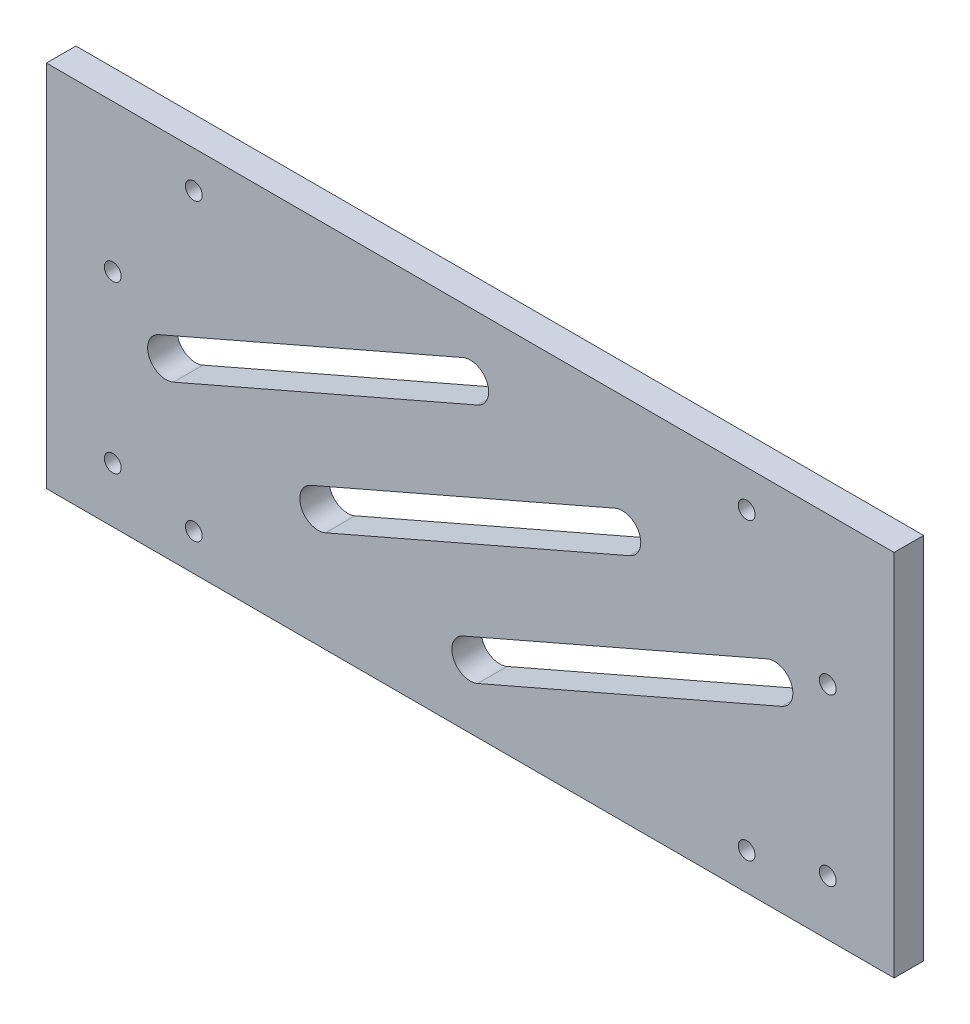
from build123d import *

# Parameters (mm, degrees)
SKETCH1_W           = 230
SKETCH1_H           = 100
SKETCH1_R           = 2.285
BOSS_EXTRUDE1_DEPTH = 8


with BuildPart() as part:
    # Sketch1 → Boss-Extrude1 (new body)
    with BuildSketch(Plane.XY):
        Rectangle(SKETCH1_W, SKETCH1_H)
        with Locations((-97, 10)):
            Circle(SKETCH1_R, mode=Mode.SUBTRACT)
        with Locations((-97, -35)):
            Circle(SKETCH1_R, mode=Mode.SUBTRACT)
        with Locations((-75, -40)):
            Circle(SKETCH1_R, mode=Mode.SUBTRACT)
        with Locations(Location((75, -40, 0), (0, 0, 180))):
            Circle(SKETCH1_R, mode=Mode.SUBTRACT)
        with Locations(Location((97, -35, 0), (0, 0, 180))):
            Circle(SKETCH1_R, mode=Mode.SUBTRACT)
        with Locations(Location((97, 10, 0), (0, 0, 180))):
            Circle(SKETCH1_R, mode=Mode.SUBTRACT)
        with Locations((75, 40)):
            Circle(SKETCH1_R, mode=Mode.SUBTRACT)
        with Locations(Location((-75, 40, 0), (0, 0, 180))):
            Circle(SKETCH1_R, mode=Mode.SUBTRACT)
        with BuildLine():
            Line((-84.52993562, 1.412877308), (-1.993630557, 37.298227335))
            ThreePointArc((-1.993630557, 37.298227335), (4.585350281, 34.706507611), (1.993630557, 28.127526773))
            Line((1.993630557, 28.127526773), (-80.542674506, -7.757823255))
            ThreePointArc((-80.542674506, -7.757823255), (-87.121655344, -5.166103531), (-84.52993562, 1.412877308))
        make_face(mode=Mode.SUBTRACT)
        with BuildLine():
            Line((-43.261783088, -13.357324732), (39.274521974, 22.528025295))
            ThreePointArc((39.274521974, 22.528025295), (45.853502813, 19.936305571), (43.261783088, 13.357324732))
            Line((43.261783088, 13.357324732), (-39.274521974, -22.528025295))
            ThreePointArc((-39.274521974, -22.528025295), (-45.853502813, -19.936305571), (-43.261783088, -13.357324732))
        make_face(mode=Mode.SUBTRACT)
        with BuildLine():
            Line((-1.993630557, -28.127526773), (80.542674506, 7.757823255))
            ThreePointArc((80.542674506, 7.757823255), (87.121655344, 5.166103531), (84.52993562, -1.412877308))
            Line((84.52993562, -1.412877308), (1.993630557, -37.298227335))
            ThreePointArc((1.993630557, -37.298227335), (-4.585350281, -34.706507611), (-1.993630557, -28.127526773))
        make_face(mode=Mode.SUBTRACT)
    extrude(amount=BOSS_EXTRUDE1_DEPTH)


solid = part.part
